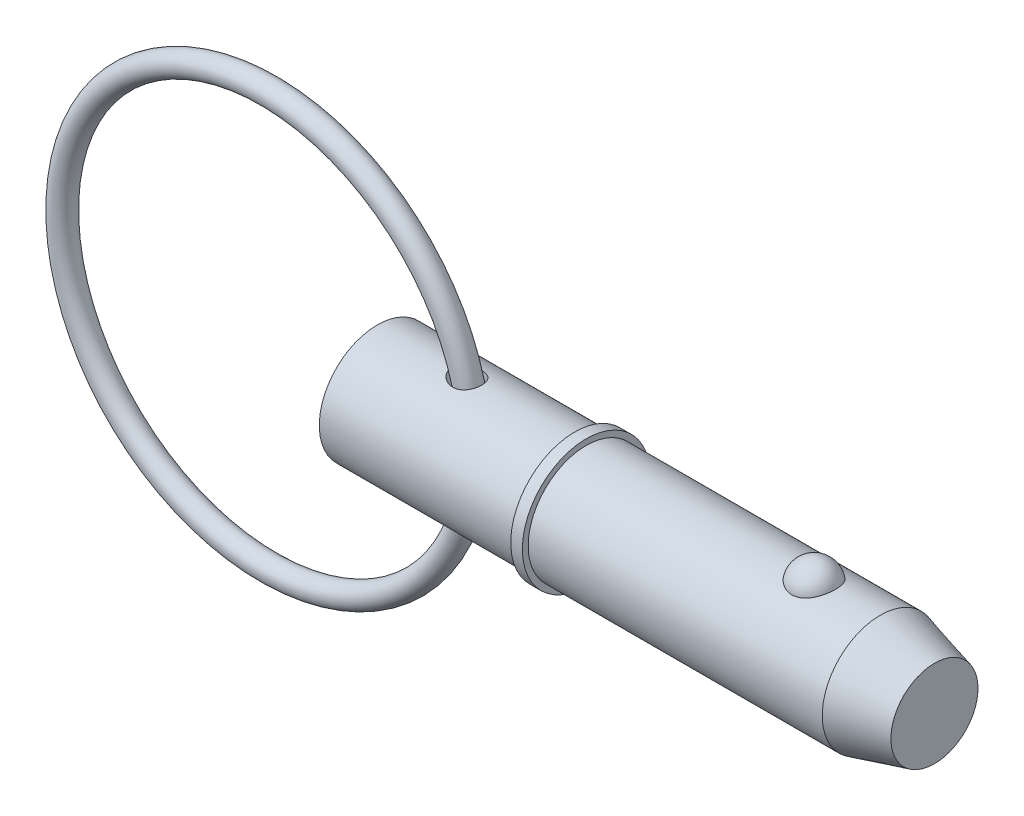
ISO-10303-21;
HEADER;
FILE_DESCRIPTION(('STEP AP214'),'2;1');
FILE_NAME('part.step','',(''),(''),'','','');
FILE_SCHEMA(('AUTOMOTIVE_DESIGN { 1 0 10303 214 1 1 1 1 }'));
ENDSEC;
DATA;
#1=APPLICATION_CONTEXT('core data for automotive mechanical design processes');
#2=APPLICATION_PROTOCOL_DEFINITION('international standard','automotive_design',2000,#1);
#3=PRODUCT_CONTEXT('',#1,'mechanical');
#4=PRODUCT('Part','Part','',(#3));
#5=PRODUCT_RELATED_PRODUCT_CATEGORY('part','',(#4));
#6=PRODUCT_DEFINITION_FORMATION('','',#4);
#7=PRODUCT_DEFINITION_CONTEXT('part definition',#1,'design');
#8=PRODUCT_DEFINITION('design','',#6,#7);
#9=PRODUCT_DEFINITION_SHAPE('','',#8);
#10=(LENGTH_UNIT() NAMED_UNIT(*) SI_UNIT(.MILLI.,.METRE.));
#11=(NAMED_UNIT(*) PLANE_ANGLE_UNIT() SI_UNIT($,.RADIAN.));
#12=(NAMED_UNIT(*) SI_UNIT($,.STERADIAN.) SOLID_ANGLE_UNIT());
#13=UNCERTAINTY_MEASURE_WITH_UNIT(LENGTH_MEASURE(1.E-05),#10,'distance_accuracy_value','');
#14=(GEOMETRIC_REPRESENTATION_CONTEXT(3) GLOBAL_UNCERTAINTY_ASSIGNED_CONTEXT((#13)) GLOBAL_UNIT_ASSIGNED_CONTEXT((#10,
#11,#12)) REPRESENTATION_CONTEXT('',''));
#15=CARTESIAN_POINT('',(0.,0.,0.));
#16=DIRECTION('',(0.,0.,1.));
#17=DIRECTION('',(1.,0.,0.));
#18=AXIS2_PLACEMENT_3D('',#15,#16,#17);
#19=CARTESIAN_POINT('',(-13.3805387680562,0.,0.));
#20=DIRECTION('',(0.,0.,1.));
#21=DIRECTION('',(1.,0.,0.));
#22=AXIS2_PLACEMENT_3D('',#19,#20,#21);
#23=TOROIDAL_SURFACE('',#22,25.4,1.429);
#24=CARTESIAN_POINT('',(13.4484612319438,0.,0.));
#25=VERTEX_POINT('',#24);
#26=VERTEX_LOOP('',#25);
#27=FACE_BOUND('',#26,.T.);
#28=ADVANCED_FACE('P0_F12',(#27),#23,.T.);
#29=CLOSED_SHELL('',(#28));
#30=MANIFOLD_SOLID_BREP('P0_B1',#29);
#31=CARTESIAN_POINT('',(0.,0.,0.));
#32=DIRECTION('',(1.,0.,0.));
#33=DIRECTION('',(0.,0.,-1.));
#34=AXIS2_PLACEMENT_3D('',#31,#32,#33);
#35=CYLINDRICAL_SURFACE('',#34,7.145);
#36=CARTESIAN_POINT('',(9.43029029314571,7.0820748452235,-0.94617170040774));
#37=CARTESIAN_POINT('',(9.49289741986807,7.07004660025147,-1.03619677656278));
#38=CARTESIAN_POINT('',(9.56370593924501,7.05703049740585,-1.12049617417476));
#39=CARTESIAN_POINT('',(9.71869321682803,7.03060933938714,-1.27585605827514));
#40=CARTESIAN_POINT('',(9.80290151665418,7.01720347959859,-1.34688652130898));
#41=CARTESIAN_POINT('',(9.98160385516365,6.99158714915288,-1.47408585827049));
#42=CARTESIAN_POINT('',(10.0760626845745,6.97937284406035,-1.53030346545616));
#43=CARTESIAN_POINT('',(10.2729508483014,6.95747410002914,-1.62697341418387));
#44=CARTESIAN_POINT('',(10.3753769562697,6.9477886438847,-1.66743209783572));
#45=CARTESIAN_POINT('',(10.5898946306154,6.93181594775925,-1.73266776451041));
#46=CARTESIAN_POINT('',(10.7022085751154,6.92567913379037,-1.75675727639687));
#47=CARTESIAN_POINT('',(10.9294935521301,6.91839634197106,-1.78523005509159));
#48=CARTESIAN_POINT('',(11.0444638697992,6.91724903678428,-1.78961856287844));
#49=CARTESIAN_POINT('',(11.2673249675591,6.92023954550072,-1.77801517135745));
#50=CARTESIAN_POINT('',(11.3752729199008,6.9241055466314,-1.7630715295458));
#51=CARTESIAN_POINT('',(11.5865707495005,6.93632220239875,-1.71437618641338));
#52=CARTESIAN_POINT('',(11.6899227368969,6.94467077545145,-1.68063321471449));
#53=CARTESIAN_POINT('',(11.8814537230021,6.96412118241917,-1.59802791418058));
#54=CARTESIAN_POINT('',(11.9701885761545,6.97498839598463,-1.55039425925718));
#55=CARTESIAN_POINT('',(12.1379548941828,6.99847346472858,-1.44066970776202));
#56=CARTESIAN_POINT('',(12.216987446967,7.01109112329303,-1.37858043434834));
#57=CARTESIAN_POINT('',(12.3614636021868,7.03632910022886,-1.24326778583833));
#58=CARTESIAN_POINT('',(12.4271729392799,7.04894297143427,-1.17032635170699));
#59=CARTESIAN_POINT('',(12.5455377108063,7.07306867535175,-1.01436746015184));
#60=CARTESIAN_POINT('',(12.5981928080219,7.08458047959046,-0.931349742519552));
#61=CARTESIAN_POINT('',(12.6896059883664,7.10535787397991,-0.756770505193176));
#62=CARTESIAN_POINT('',(12.7282356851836,7.11460247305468,-0.665139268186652));
#63=CARTESIAN_POINT('',(12.7900431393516,7.12971795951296,-0.476541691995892));
#64=CARTESIAN_POINT('',(12.8132203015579,7.13558871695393,-0.379575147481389));
#65=CARTESIAN_POINT('',(12.843715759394,7.14336270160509,-0.182249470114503));
#66=CARTESIAN_POINT('',(12.8509095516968,7.14523477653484,-0.081869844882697));
#67=CARTESIAN_POINT('',(12.8489064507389,7.14471772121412,0.118715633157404));
#68=CARTESIAN_POINT('',(12.8397092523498,7.14232851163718,0.218921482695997));
#69=CARTESIAN_POINT('',(12.8051110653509,7.13353949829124,0.41644658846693));
#70=CARTESIAN_POINT('',(12.7796895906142,7.12713462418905,0.513762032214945));
#71=CARTESIAN_POINT('',(12.7132079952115,7.1110024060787,0.702607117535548));
#72=CARTESIAN_POINT('',(12.6721476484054,7.10127501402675,0.79413667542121));
#73=CARTESIAN_POINT('',(12.5754142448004,7.07957648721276,0.968687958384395));
#74=CARTESIAN_POINT('',(12.5197583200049,7.06760798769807,1.05171950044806));
#75=CARTESIAN_POINT('',(12.3951873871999,7.04275315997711,1.20699878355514));
#76=CARTESIAN_POINT('',(12.3262733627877,7.02986689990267,1.27924732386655));
#77=CARTESIAN_POINT('',(12.1775943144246,7.00473797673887,1.41035599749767));
#78=CARTESIAN_POINT('',(12.0979195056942,6.99249102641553,1.46931758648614));
#79=CARTESIAN_POINT('',(11.9295314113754,6.96991222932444,1.57295053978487));
#80=CARTESIAN_POINT('',(11.840819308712,6.9595801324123,1.61762377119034));
#81=CARTESIAN_POINT('',(11.6577653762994,6.9420462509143,1.69128599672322));
#82=CARTESIAN_POINT('',(11.5634812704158,6.93481718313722,1.72041226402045));
#83=CARTESIAN_POINT('',(11.3712731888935,6.92407027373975,1.76316901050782));
#84=CARTESIAN_POINT('',(11.2733489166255,6.92055273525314,1.7767982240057));
#85=CARTESIAN_POINT('',(11.0745092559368,6.91745053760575,1.78883853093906));
#86=CARTESIAN_POINT('',(10.9735737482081,6.91794816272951,1.7869312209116));
#87=CARTESIAN_POINT('',(10.7732766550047,6.92286647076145,1.76777696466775));
#88=CARTESIAN_POINT('',(10.6739155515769,6.92728833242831,1.75052540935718));
#89=CARTESIAN_POINT('',(10.4726907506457,6.93987626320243,1.69995986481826));
#90=CARTESIAN_POINT('',(10.3710860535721,6.94826759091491,1.66567223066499));
#91=CARTESIAN_POINT('',(10.1746512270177,6.96783543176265,1.5818155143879));
#92=CARTESIAN_POINT('',(10.0798244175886,6.97901329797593,1.53223900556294));
#93=CARTESIAN_POINT('',(9.89353725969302,7.00369413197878,1.41530336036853));
#94=CARTESIAN_POINT('',(9.80266896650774,7.01729943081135,1.34701798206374));
#95=CARTESIAN_POINT('',(9.63408859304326,7.0446567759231,1.19571433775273));
#96=CARTESIAN_POINT('',(9.55637809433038,7.05840883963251,1.11269430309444));
#97=CARTESIAN_POINT('',(9.41909992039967,7.083998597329,0.935821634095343));
#98=CARTESIAN_POINT('',(9.35912834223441,7.09587546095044,0.842290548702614));
#99=CARTESIAN_POINT('',(9.25811978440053,7.11649414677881,0.645207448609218));
#100=CARTESIAN_POINT('',(9.21705789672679,7.12524008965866,0.541668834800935));
#101=CARTESIAN_POINT('',(9.16044503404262,7.13745944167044,0.341322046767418));
#102=CARTESIAN_POINT('',(9.14237352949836,7.14144984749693,0.245257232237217));
#103=CARTESIAN_POINT('',(9.12416132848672,7.14547143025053,0.0513577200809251));
#104=CARTESIAN_POINT('',(9.12401221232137,7.14550446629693,-0.0464761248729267));
#105=CARTESIAN_POINT('',(9.14075660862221,7.14180686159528,-0.230866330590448));
#106=CARTESIAN_POINT('',(9.15598246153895,7.13844450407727,-0.317588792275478));
#107=CARTESIAN_POINT('',(9.20015637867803,7.1288735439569,-0.487231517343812));
#108=CARTESIAN_POINT('',(9.22909411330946,7.12266708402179,-0.570154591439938));
#109=CARTESIAN_POINT('',(9.2869632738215,7.11060500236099,-0.702183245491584));
#110=CARTESIAN_POINT('',(9.3123377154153,7.10538970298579,-0.752949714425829));
#111=CARTESIAN_POINT('',(9.36784352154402,7.09422889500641,-0.851709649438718));
#112=CARTESIAN_POINT('',(9.39797435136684,7.08828346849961,-0.899703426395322));
#113=CARTESIAN_POINT('',(9.43029029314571,7.0820748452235,-0.94617170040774));
#114=B_SPLINE_CURVE_WITH_KNOTS('',3,(#36,#37,#38,#39,#40,#41,#42,#43,#44,#45,#46,#47,#48,#49,
#50,#51,#52,#53,#54,#55,#56,#57,#58,#59,#60,#61,#62,#63,#64,#65,#66,#67,#68,#69,#70,#71,#72,#73,
#74,#75,#76,#77,#78,#79,#80,#81,#82,#83,#84,#85,#86,#87,#88,#89,#90,#91,#92,#93,#94,#95,#96,#97,
#98,#99,#100,#101,#102,#103,#104,#105,#106,#107,#108,#109,#110,#111,#112,#113),.UNSPECIFIED.,
.T.,.F.,(4,2,2,2,2,2,2,2,2,2,2,2,2,2,2,2,2,2,2,2,2,2,2,2,2,2,2,2,2,2,2,2,2,2,2,2,2,2,4),(0.,
0.330712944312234,0.662165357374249,0.992513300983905,1.32272815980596,1.66607248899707,
2.00932547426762,2.33472339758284,2.65997034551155,2.96236844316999,3.26473260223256,
3.56029376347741,3.85586255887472,4.15407251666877,4.45229395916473,4.75283038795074,
5.05337241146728,5.35429467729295,5.6552212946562,5.95579625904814,6.25634893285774,
6.55452242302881,6.85265693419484,7.14811357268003,7.44359434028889,7.74514565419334,
8.04678757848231,8.36809025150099,8.68954924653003,9.03133562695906,9.37316306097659,
9.70647113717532,10.0393389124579,10.3311793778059,10.6228827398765,10.8860177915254,
11.1489549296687,11.3196783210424,11.4903825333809),.UNSPECIFIED.);
#115=CARTESIAN_POINT('',(9.43029029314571,7.0820748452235,-0.94617170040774));
#116=VERTEX_POINT('',#115);
#117=EDGE_CURVE('P1_E42',#116,#116,#114,.T.);
#118=ORIENTED_EDGE('',*,*,#117,.T.);
#119=EDGE_LOOP('',(#118));
#120=FACE_BOUND('',#119,.T.);
#121=CARTESIAN_POINT('',(0.,0.,0.));
#122=DIRECTION('',(1.,0.,0.));
#123=DIRECTION('',(0.,0.,-1.));
#124=AXIS2_PLACEMENT_3D('',#121,#122,#123);
#125=CIRCLE('',#124,7.145);
#126=CARTESIAN_POINT('',(0.,0.,-7.145));
#127=VERTEX_POINT('',#126);
#128=EDGE_CURVE('P1_E9',#127,#127,#125,.T.);
#129=ORIENTED_EDGE('',*,*,#128,.T.);
#130=EDGE_LOOP('',(#129));
#131=FACE_BOUND('',#130,.T.);
#132=CARTESIAN_POINT('',(24.271,0.,0.));
#133=DIRECTION('',(1.,0.,0.));
#134=DIRECTION('',(0.,0.,-1.));
#135=AXIS2_PLACEMENT_3D('',#132,#133,#134);
#136=CIRCLE('',#135,7.145);
#137=CARTESIAN_POINT('',(24.271,0.,-7.145));
#138=VERTEX_POINT('',#137);
#139=EDGE_CURVE('P1_E25',#138,#138,#136,.T.);
#140=ORIENTED_EDGE('',*,*,#139,.F.);
#141=EDGE_LOOP('',(#140));
#142=FACE_BOUND('',#141,.T.);
#143=CARTESIAN_POINT('',(9.43029029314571,-7.0820748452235,-0.94617170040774));
#144=CARTESIAN_POINT('',(9.37760063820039,-7.09219753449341,-0.870403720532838));
#145=CARTESIAN_POINT('',(9.33068640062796,-7.10162619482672,-0.790535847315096));
#146=CARTESIAN_POINT('',(9.25028000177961,-7.11818229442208,-0.624083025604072));
#147=CARTESIAN_POINT('',(9.21677847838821,-7.12531133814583,-0.53750281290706));
#148=CARTESIAN_POINT('',(9.16475883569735,-7.13651886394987,-0.359324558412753));
#149=CARTESIAN_POINT('',(9.14630423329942,-7.14058440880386,-0.267706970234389));
#150=CARTESIAN_POINT('',(9.12573334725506,-7.14512216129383,-0.082561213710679));
#151=CARTESIAN_POINT('',(9.12361335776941,-7.1455951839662,0.0109665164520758));
#152=CARTESIAN_POINT('',(9.13548667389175,-7.14296952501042,0.191627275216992));
#153=CARTESIAN_POINT('',(9.14858103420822,-7.14007009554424,0.278824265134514));
#154=CARTESIAN_POINT('',(9.18869656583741,-7.1313430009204,0.449782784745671));
#155=CARTESIAN_POINT('',(9.21571947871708,-7.1255149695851,0.533543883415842));
#156=CARTESIAN_POINT('',(9.282939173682,-7.11140544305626,0.696984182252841));
#157=CARTESIAN_POINT('',(9.32334793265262,-7.10308469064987,0.776572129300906));
#158=CARTESIAN_POINT('',(9.41555290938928,-7.08481187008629,0.928623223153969));
#159=CARTESIAN_POINT('',(9.4673531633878,-7.07485922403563,1.00108383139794));
#160=CARTESIAN_POINT('',(9.58690514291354,-7.05302654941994,1.14530893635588));
#161=CARTESIAN_POINT('',(9.65578345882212,-7.04105486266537,1.21612477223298));
#162=CARTESIAN_POINT('',(9.80342908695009,-7.01727063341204,1.34660507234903));
#163=CARTESIAN_POINT('',(9.88220203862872,-7.00545818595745,1.40626312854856));
#164=CARTESIAN_POINT('',(10.0573217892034,-6.9817739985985,1.51973713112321));
#165=CARTESIAN_POINT('',(10.1546474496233,-6.9700532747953,1.57208037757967));
#166=CARTESIAN_POINT('',(10.3567277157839,-6.94950828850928,1.66055104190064));
#167=CARTESIAN_POINT('',(10.4614845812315,-6.94068491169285,1.69667350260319));
#168=CARTESIAN_POINT('',(10.6792116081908,-6.92685379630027,1.75230777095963));
#169=CARTESIAN_POINT('',(10.7923373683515,-6.92197732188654,1.77125049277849));
#170=CARTESIAN_POINT('',(11.0202699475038,-6.91736328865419,1.78919210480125));
#171=CARTESIAN_POINT('',(11.1350759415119,-6.91762328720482,1.78820047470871));
#172=CARTESIAN_POINT('',(11.355627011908,-6.92328130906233,1.76615765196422));
#173=CARTESIAN_POINT('',(11.4615007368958,-6.92836826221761,1.74632083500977));
#174=CARTESIAN_POINT('',(11.6678083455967,-6.94272508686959,1.68833625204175));
#175=CARTESIAN_POINT('',(11.7682443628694,-6.9519933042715,1.65019572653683));
#176=CARTESIAN_POINT('',(11.9539217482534,-6.97285816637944,1.55957439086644));
#177=CARTESIAN_POINT('',(12.0397280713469,-6.98426147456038,1.50820229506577));
#178=CARTESIAN_POINT('',(12.2011249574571,-7.00842344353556,1.39160266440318));
#179=CARTESIAN_POINT('',(12.276716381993,-7.0211819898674,1.32637629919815));
#180=CARTESIAN_POINT('',(12.4144868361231,-7.04639315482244,1.18508369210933));
#181=CARTESIAN_POINT('',(12.4768620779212,-7.05884739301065,1.10920872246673));
#182=CARTESIAN_POINT('',(12.5881779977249,-7.08230185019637,0.947973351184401));
#183=CARTESIAN_POINT('',(12.6371182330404,-7.09330202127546,0.862612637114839));
#184=CARTESIAN_POINT('',(12.7208404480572,-7.11277016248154,0.683871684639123));
#185=CARTESIAN_POINT('',(12.7554736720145,-7.12121129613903,0.590418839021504));
#186=CARTESIAN_POINT('',(12.8090653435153,-7.13450309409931,0.398877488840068));
#187=CARTESIAN_POINT('',(12.8280232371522,-7.13935363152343,0.300788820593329));
#188=CARTESIAN_POINT('',(12.8499077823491,-7.14496695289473,0.102058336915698));
#189=CARTESIAN_POINT('',(12.8527265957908,-7.14570223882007,0.0014038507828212));
#190=CARTESIAN_POINT('',(12.8419792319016,-7.14293198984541,-0.198968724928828));
#191=CARTESIAN_POINT('',(12.8284127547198,-7.13942637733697,-0.298686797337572));
#192=CARTESIAN_POINT('',(12.7851853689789,-7.12854635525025,-0.494442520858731));
#193=CARTESIAN_POINT('',(12.7555107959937,-7.12116866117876,-0.590476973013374));
#194=CARTESIAN_POINT('',(12.6807437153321,-7.10334272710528,-0.776042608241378));
#195=CARTESIAN_POINT('',(12.6356510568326,-7.09289445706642,-0.865573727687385));
#196=CARTESIAN_POINT('',(12.5312128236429,-7.07009703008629,-1.03541867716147));
#197=CARTESIAN_POINT('',(12.4718917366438,-7.0577511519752,-1.11574799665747));
#198=CARTESIAN_POINT('',(12.3404461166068,-7.03252701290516,-1.26504204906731));
#199=CARTESIAN_POINT('',(12.2683227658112,-7.01964880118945,-1.33400783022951));
#200=CARTESIAN_POINT('',(12.1139052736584,-6.99493588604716,-1.45803732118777));
#201=CARTESIAN_POINT('',(12.031708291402,-6.98309284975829,-1.51322032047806));
#202=CARTESIAN_POINT('',(11.858962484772,-6.96164945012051,-1.60900039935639));
#203=CARTESIAN_POINT('',(11.7684146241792,-6.95204882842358,-1.6495991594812));
#204=CARTESIAN_POINT('',(11.5822744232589,-6.93618392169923,-1.71508374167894));
#205=CARTESIAN_POINT('',(11.4867225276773,-6.92989640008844,-1.74007923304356));
#206=CARTESIAN_POINT('',(11.292703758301,-6.92114809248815,-1.77455680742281));
#207=CARTESIAN_POINT('',(11.1942365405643,-6.91868775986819,-1.7840370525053));
#208=CARTESIAN_POINT('',(10.9943797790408,-6.91771041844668,-1.78782317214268));
#209=CARTESIAN_POINT('',(10.8929824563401,-6.9193005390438,-1.78171679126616));
#210=CARTESIAN_POINT('',(10.6924353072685,-6.92632816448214,-1.75419409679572));
#211=CARTESIAN_POINT('',(10.5932861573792,-6.93176681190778,-1.73277323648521));
#212=CARTESIAN_POINT('',(10.3927770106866,-6.94630717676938,-1.67356884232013));
#213=CARTESIAN_POINT('',(10.2917367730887,-6.95563581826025,-1.63475796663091));
#214=CARTESIAN_POINT('',(10.0971768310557,-6.97681957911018,-1.54184188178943));
#215=CARTESIAN_POINT('',(10.0036623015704,-6.9886764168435,-1.48772626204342));
#216=CARTESIAN_POINT('',(9.82098935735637,-7.01440230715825,-1.36146688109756));
#217=CARTESIAN_POINT('',(9.73247440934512,-7.0283510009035,-1.28840361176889));
#218=CARTESIAN_POINT('',(9.56978695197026,-7.05591334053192,-1.12770855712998));
#219=CARTESIAN_POINT('',(9.49560170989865,-7.06952727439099,-1.0400898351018));
#220=CARTESIAN_POINT('',(9.43029029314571,-7.0820748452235,-0.94617170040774));
#221=B_SPLINE_CURVE_WITH_KNOTS('',3,(#143,#144,#145,#146,#147,#148,#149,#150,#151,#152,#153,
#154,#155,#156,#157,#158,#159,#160,#161,#162,#163,#164,#165,#166,#167,#168,#169,#170,#171,#172,
#173,#174,#175,#176,#177,#178,#179,#180,#181,#182,#183,#184,#185,#186,#187,#188,#189,#190,#191,
#192,#193,#194,#195,#196,#197,#198,#199,#200,#201,#202,#203,#204,#205,#206,#207,#208,#209,#210,
#211,#212,#213,#214,#215,#216,#217,#218,#219,#220),.UNSPECIFIED.,.T.,.F.,(4,2,2,2,2,2,2,2,2,2,2,
2,2,2,2,2,2,2,2,2,2,2,2,2,2,2,2,2,2,2,2,2,2,2,2,2,2,2,4),(0.,0.278197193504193,
0.556199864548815,0.835370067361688,1.11447693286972,1.37789669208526,1.64134939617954,
1.90919123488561,2.17712812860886,2.47446254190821,2.77196719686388,3.10386520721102,
3.43586457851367,3.77849767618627,4.1209678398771,4.44276705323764,4.76443907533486,
5.0649452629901,5.36542609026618,5.66107282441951,5.95672929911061,6.25538683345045,
6.5540549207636,6.85471634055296,7.15538326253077,7.45630563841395,7.75723095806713,
8.05764204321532,8.35802540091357,8.65571107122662,8.95336242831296,9.24889743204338,
9.54446744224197,9.84793560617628,10.1514939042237,10.4760045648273,10.8007364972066,
11.1458836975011,11.4907227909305),.UNSPECIFIED.);
#222=CARTESIAN_POINT('',(9.43029029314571,-7.0820748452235,-0.94617170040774));
#223=VERTEX_POINT('',#222);
#224=EDGE_CURVE('P1_E17',#223,#223,#221,.T.);
#225=ORIENTED_EDGE('',*,*,#224,.T.);
#226=EDGE_LOOP('',(#225));
#227=FACE_BOUND('',#226,.T.);
#228=ADVANCED_FACE('P1_F13',(#120,#131,#142,#227),#35,.T.);
#229=CARTESIAN_POINT('',(0.,0.,0.));
#230=DIRECTION('',(1.,0.,0.));
#231=DIRECTION('',(0.,0.,-1.));
#232=AXIS2_PLACEMENT_3D('',#229,#230,#231);
#233=CYLINDRICAL_SURFACE('',#232,7.145);
#234=CARTESIAN_POINT('',(61.8836242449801,0.,0.));
#235=DIRECTION('',(1.,0.,0.));
#236=DIRECTION('',(0.,0.,-1.));
#237=AXIS2_PLACEMENT_3D('',#234,#235,#236);
#238=CIRCLE('',#237,7.145);
#239=CARTESIAN_POINT('',(61.8836242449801,0.,-7.145));
#240=VERTEX_POINT('',#239);
#241=EDGE_CURVE('P1_E99',#240,#240,#238,.T.);
#242=ORIENTED_EDGE('',*,*,#241,.F.);
#243=EDGE_LOOP('',(#242));
#244=FACE_BOUND('',#243,.T.);
#245=CARTESIAN_POINT('',(25.7,0.,0.));
#246=DIRECTION('',(1.,0.,0.));
#247=DIRECTION('',(0.,0.,-1.));
#248=AXIS2_PLACEMENT_3D('',#245,#246,#247);
#249=CIRCLE('',#248,7.145);
#250=CARTESIAN_POINT('',(25.7,0.,-7.145));
#251=VERTEX_POINT('',#250);
#252=EDGE_CURVE('P1_E96',#251,#251,#249,.T.);
#253=ORIENTED_EDGE('',*,*,#252,.T.);
#254=EDGE_LOOP('',(#253));
#255=FACE_BOUND('',#254,.T.);
#256=CARTESIAN_POINT('',(53.7395037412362,6.60328629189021,2.72903557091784));
#257=CARTESIAN_POINT('',(53.598315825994,6.60329644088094,2.72902496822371));
#258=CARTESIAN_POINT('',(53.4568832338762,6.60799490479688,2.71772840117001));
#259=CARTESIAN_POINT('',(53.1779557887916,6.62628236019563,2.67281935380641));
#260=CARTESIAN_POINT('',(53.0404726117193,6.63989534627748,2.63914664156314));
#261=CARTESIAN_POINT('',(52.7738894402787,6.67440775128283,2.55059642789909));
#262=CARTESIAN_POINT('',(52.6447683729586,6.69528793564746,2.49577486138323));
#263=CARTESIAN_POINT('',(52.3978694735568,6.74205585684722,2.3665179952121));
#264=CARTESIAN_POINT('',(52.2800865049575,6.76794130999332,2.29209163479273));
#265=CARTESIAN_POINT('',(52.0551671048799,6.82286177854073,2.1231293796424));
#266=CARTESIAN_POINT('',(51.9484405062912,6.85196655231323,2.02807107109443));
#267=CARTESIAN_POINT('',(51.7519181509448,6.90970232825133,1.82167822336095));
#268=CARTESIAN_POINT('',(51.6621276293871,6.93833318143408,1.71033867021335));
#269=CARTESIAN_POINT('',(51.4976670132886,6.9935167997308,1.46891951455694));
#270=CARTESIAN_POINT('',(51.423844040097,7.01992110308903,1.33822781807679));
#271=CARTESIAN_POINT('',(51.2980884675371,7.06643385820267,1.06566567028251));
#272=CARTESIAN_POINT('',(51.2461573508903,7.08654188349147,0.923794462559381));
#273=CARTESIAN_POINT('',(51.1647323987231,7.11862399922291,0.630993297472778));
#274=CARTESIAN_POINT('',(51.1355167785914,7.13049704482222,0.479974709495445));
#275=CARTESIAN_POINT('',(51.1011742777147,7.14449484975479,0.174782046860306));
#276=CARTESIAN_POINT('',(51.0960466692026,7.14661990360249,0.0206080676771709));
#277=CARTESIAN_POINT('',(51.109938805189,7.14092465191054,-0.285506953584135));
#278=CARTESIAN_POINT('',(51.1288101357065,7.1331654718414,-0.437455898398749));
#279=CARTESIAN_POINT('',(51.1900622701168,7.10859076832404,-0.735778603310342));
#280=CARTESIAN_POINT('',(51.2324435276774,7.0917750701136,-0.882152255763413));
#281=CARTESIAN_POINT('',(51.3399346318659,7.05076716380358,-1.16543149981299));
#282=CARTESIAN_POINT('',(51.4050759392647,7.02656475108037,-1.30232366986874));
#283=CARTESIAN_POINT('',(51.5567597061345,6.97329145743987,-1.56265907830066));
#284=CARTESIAN_POINT('',(51.643303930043,6.94422017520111,-1.68610120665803));
#285=CARTESIAN_POINT('',(51.8364654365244,6.88415108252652,-1.9167100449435));
#286=CARTESIAN_POINT('',(51.9431807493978,6.85314438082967,-2.02379244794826));
#287=CARTESIAN_POINT('',(52.1739740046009,6.79282069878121,-2.21787433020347));
#288=CARTESIAN_POINT('',(52.2980505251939,6.76350358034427,-2.30487545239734));
#289=CARTESIAN_POINT('',(52.5576784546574,6.71060580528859,-2.45458647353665));
#290=CARTESIAN_POINT('',(52.6929387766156,6.68691885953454,-2.51776240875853));
#291=CARTESIAN_POINT('',(52.9732778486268,6.64741247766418,-2.62030218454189));
#292=CARTESIAN_POINT('',(53.118352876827,6.63159007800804,-2.65967499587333));
#293=CARTESIAN_POINT('',(53.4063475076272,6.61038594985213,-2.71193301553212));
#294=CARTESIAN_POINT('',(53.5490080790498,6.60451880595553,-2.72605165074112));
#295=CARTESIAN_POINT('',(53.8348004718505,6.60240611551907,-2.73116688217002));
#296=CARTESIAN_POINT('',(53.9779321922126,6.60615862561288,-2.72216814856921));
#297=CARTESIAN_POINT('',(54.2558486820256,6.62256094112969,-2.68200435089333));
#298=CARTESIAN_POINT('',(54.3907542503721,6.63492533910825,-2.65154998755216));
#299=CARTESIAN_POINT('',(54.65332009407,6.66687445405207,-2.5701568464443));
#300=CARTESIAN_POINT('',(54.7809797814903,6.68645975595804,-2.51921640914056));
#301=CARTESIAN_POINT('',(55.0285777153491,6.73127274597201,-2.39693610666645));
#302=CARTESIAN_POINT('',(55.148287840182,6.75661381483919,-2.32517694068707));
#303=CARTESIAN_POINT('',(55.3741592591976,6.8100600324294,-2.16363812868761));
#304=CARTESIAN_POINT('',(55.480317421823,6.83816581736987,-2.07385432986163));
#305=CARTESIAN_POINT('',(55.6818620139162,6.89580469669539,-1.87357235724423));
#306=CARTESIAN_POINT('',(55.776440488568,6.92533863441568,-1.76226074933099));
#307=CARTESIAN_POINT('',(55.9463329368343,6.98139526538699,-1.52511696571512));
#308=CARTESIAN_POINT('',(56.0216434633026,7.0079174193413,-1.39928219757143));
#309=CARTESIAN_POINT('',(56.153595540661,7.05607625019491,-1.13215977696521));
#310=CARTESIAN_POINT('',(56.2095688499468,7.07753119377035,-0.99050847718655));
#311=CARTESIAN_POINT('',(56.2982965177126,7.11222355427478,-0.699154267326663));
#312=CARTESIAN_POINT('',(56.3310506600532,7.12546089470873,-0.549451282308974));
#313=CARTESIAN_POINT('',(56.3726899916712,7.14237584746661,-0.246120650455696));
#314=CARTESIAN_POINT('',(56.381558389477,7.14604673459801,-0.0924903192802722));
#315=CARTESIAN_POINT('',(56.3751940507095,7.14343510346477,0.214181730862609));
#316=CARTESIAN_POINT('',(56.3599618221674,7.13715279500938,0.367223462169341));
#317=CARTESIAN_POINT('',(56.3058451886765,7.11532948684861,0.667595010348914));
#318=CARTESIAN_POINT('',(56.2670776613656,7.09983424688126,0.814949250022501));
#319=CARTESIAN_POINT('',(56.1667700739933,7.06119140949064,1.10063221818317));
#320=CARTESIAN_POINT('',(56.1052284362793,7.03804328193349,1.23896032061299));
#321=CARTESIAN_POINT('',(55.9602071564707,6.98632429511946,1.50352300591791));
#322=CARTESIAN_POINT('',(55.8766067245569,6.95772382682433,1.62968561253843));
#323=CARTESIAN_POINT('',(55.6893804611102,6.89823072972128,1.86554304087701));
#324=CARTESIAN_POINT('',(55.5857557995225,6.86733823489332,1.97523882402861));
#325=CARTESIAN_POINT('',(55.3610769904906,6.80676456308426,2.17482293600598));
#326=CARTESIAN_POINT('',(55.2400673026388,6.7770805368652,2.26476035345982));
#327=CARTESIAN_POINT('',(54.9833408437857,6.7223050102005,2.42252989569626));
#328=CARTESIAN_POINT('',(54.8476185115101,6.69721525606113,2.49035362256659));
#329=CARTESIAN_POINT('',(54.5704022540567,6.65552591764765,2.59967646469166));
#330=CARTESIAN_POINT('',(54.4292810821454,6.63865794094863,2.6420201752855));
#331=CARTESIAN_POINT('',(54.1414448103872,6.61425039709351,2.7025584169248));
#332=CARTESIAN_POINT('',(53.9947480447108,6.606682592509,2.72082606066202));
#333=CARTESIAN_POINT('',(53.8116799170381,6.60358754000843,2.72830331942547));
#334=CARTESIAN_POINT('',(53.7755998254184,6.60328369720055,2.72903828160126));
#335=CARTESIAN_POINT('',(53.7395037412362,6.60328629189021,2.72903557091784));
#336=B_SPLINE_CURVE_WITH_KNOTS('',3,(#256,#257,#258,#259,#260,#261,#262,#263,#264,#265,#266,
#267,#268,#269,#270,#271,#272,#273,#274,#275,#276,#277,#278,#279,#280,#281,#282,#283,#284,#285,
#286,#287,#288,#289,#290,#291,#292,#293,#294,#295,#296,#297,#298,#299,#300,#301,#302,#303,#304,
#305,#306,#307,#308,#309,#310,#311,#312,#313,#314,#315,#316,#317,#318,#319,#320,#321,#322,#323,
#324,#325,#326,#327,#328,#329,#330,#331,#332,#333,#334,#335),.UNSPECIFIED.,.T.,.F.,(4,2,2,2,2,2,
2,2,2,2,2,2,2,2,2,2,2,2,2,2,2,2,2,2,2,2,2,2,2,2,2,2,2,2,2,2,2,2,2,4),(0.,0.423468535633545,
0.848081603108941,1.27157926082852,1.69488414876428,2.13051395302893,2.56627819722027,
3.02136706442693,3.47648674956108,3.93709649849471,4.39769233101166,4.85545355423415,
5.31322361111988,5.77162895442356,6.23007210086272,6.69080337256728,7.15149693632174,
7.60264329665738,8.05361952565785,8.48189729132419,8.91008854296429,9.32472524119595,
9.73939553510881,10.1630783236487,10.5868588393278,11.0319070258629,11.4770347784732,
11.9362874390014,12.3955443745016,12.8551240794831,13.3146940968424,13.7720003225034,
14.2293382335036,14.6892343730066,15.1491036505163,15.6078171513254,16.0667046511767,
16.5093965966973,16.9507410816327,17.0590049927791),.UNSPECIFIED.);
#337=CARTESIAN_POINT('',(53.7395037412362,6.60328629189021,2.72903557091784));
#338=VERTEX_POINT('',#337);
#339=EDGE_CURVE('P1_E34',#338,#338,#336,.T.);
#340=ORIENTED_EDGE('',*,*,#339,.T.);
#341=EDGE_LOOP('',(#340));
#342=FACE_BOUND('',#341,.T.);
#343=ADVANCED_FACE('P1_F46',(#244,#255,#342),#233,.T.);
#344=CARTESIAN_POINT('',(0.,0.,0.));
#345=DIRECTION('',(-1.,0.,0.));
#346=DIRECTION('',(0.,0.,1.));
#347=AXIS2_PLACEMENT_3D('',#344,#345,#346);
#348=PLANE('',#347);
#349=ORIENTED_EDGE('',*,*,#128,.F.);
#350=EDGE_LOOP('',(#349));
#351=FACE_BOUND('',#350,.T.);
#352=ADVANCED_FACE('P1_F15',(#351),#348,.T.);
#353=CARTESIAN_POINT('',(24.271,7.145,0.));
#354=DIRECTION('',(-1.,0.,0.));
#355=DIRECTION('',(0.,0.,1.));
#356=AXIS2_PLACEMENT_3D('',#353,#354,#355);
#357=PLANE('',#356);
#358=ORIENTED_EDGE('',*,*,#139,.T.);
#359=EDGE_LOOP('',(#358));
#360=FACE_BOUND('',#359,.T.);
#361=CARTESIAN_POINT('',(24.271,0.,0.));
#362=DIRECTION('',(1.,0.,0.));
#363=DIRECTION('',(0.,0.,-1.));
#364=AXIS2_PLACEMENT_3D('',#361,#362,#363);
#365=CIRCLE('',#364,7.8595);
#366=CARTESIAN_POINT('',(24.271,0.,-7.8595));
#367=VERTEX_POINT('',#366);
#368=EDGE_CURVE('P1_E30',#367,#367,#365,.T.);
#369=ORIENTED_EDGE('',*,*,#368,.F.);
#370=EDGE_LOOP('',(#369));
#371=FACE_BOUND('',#370,.T.);
#372=ADVANCED_FACE('P1_F81',(#360,#371),#357,.T.);
#373=CARTESIAN_POINT('',(0.,0.,0.));
#374=DIRECTION('',(1.,0.,0.));
#375=DIRECTION('',(0.,0.,-1.));
#376=AXIS2_PLACEMENT_3D('',#373,#374,#375);
#377=CYLINDRICAL_SURFACE('',#376,7.8595);
#378=ORIENTED_EDGE('',*,*,#368,.T.);
#379=EDGE_LOOP('',(#378));
#380=FACE_BOUND('',#379,.T.);
#381=CARTESIAN_POINT('',(25.7,0.,0.));
#382=DIRECTION('',(1.,0.,0.));
#383=DIRECTION('',(0.,0.,-1.));
#384=AXIS2_PLACEMENT_3D('',#381,#382,#383);
#385=CIRCLE('',#384,7.8595);
#386=CARTESIAN_POINT('',(25.7,0.,-7.8595));
#387=VERTEX_POINT('',#386);
#388=EDGE_CURVE('P1_E95',#387,#387,#385,.T.);
#389=ORIENTED_EDGE('',*,*,#388,.F.);
#390=EDGE_LOOP('',(#389));
#391=FACE_BOUND('',#390,.T.);
#392=ADVANCED_FACE('P1_F68',(#380,#391),#377,.T.);
#393=CARTESIAN_POINT('',(25.7,7.8595,0.));
#394=DIRECTION('',(1.,0.,0.));
#395=DIRECTION('',(0.,0.,-1.));
#396=AXIS2_PLACEMENT_3D('',#393,#394,#395);
#397=PLANE('',#396);
#398=ORIENTED_EDGE('',*,*,#388,.T.);
#399=EDGE_LOOP('',(#398));
#400=FACE_BOUND('',#399,.T.);
#401=ORIENTED_EDGE('',*,*,#252,.F.);
#402=EDGE_LOOP('',(#401));
#403=FACE_BOUND('',#402,.T.);
#404=ADVANCED_FACE('P1_F62',(#400,#403),#397,.T.);
#405=CARTESIAN_POINT('',(68.55,0.,0.));
#406=DIRECTION('',(-1.,0.,0.));
#407=DIRECTION('',(0.,0.,1.));
#408=AXIS2_PLACEMENT_3D('',#405,#406,#407);
#409=CONICAL_SURFACE('',#408,5.35875000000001,0.261799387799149);
#410=ORIENTED_EDGE('',*,*,#241,.T.);
#411=EDGE_LOOP('',(#410));
#412=FACE_BOUND('',#411,.T.);
#413=CARTESIAN_POINT('',(68.55,0.,0.));
#414=DIRECTION('',(1.,0.,0.));
#415=DIRECTION('',(0.,0.,-1.));
#416=AXIS2_PLACEMENT_3D('',#413,#414,#415);
#417=CIRCLE('',#416,5.35875000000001);
#418=CARTESIAN_POINT('',(68.55,0.,-5.35875000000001));
#419=VERTEX_POINT('',#418);
#420=EDGE_CURVE('P1_E41',#419,#419,#417,.T.);
#421=ORIENTED_EDGE('',*,*,#420,.F.);
#422=EDGE_LOOP('',(#421));
#423=FACE_BOUND('',#422,.T.);
#424=ADVANCED_FACE('P1_F59',(#412,#423),#409,.T.);
#425=CARTESIAN_POINT('',(68.55,5.35875000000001,0.));
#426=DIRECTION('',(1.,0.,0.));
#427=DIRECTION('',(0.,0.,-1.));
#428=AXIS2_PLACEMENT_3D('',#425,#426,#427);
#429=PLANE('',#428);
#430=ORIENTED_EDGE('',*,*,#420,.T.);
#431=EDGE_LOOP('',(#430));
#432=FACE_BOUND('',#431,.T.);
#433=ADVANCED_FACE('P1_F55',(#432),#429,.T.);
#434=CARTESIAN_POINT('',(53.7395037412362,6.43049999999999,0.));
#435=DIRECTION('',(-1.,0.,0.));
#436=DIRECTION('',(0.,1.,0.));
#437=AXIS2_PLACEMENT_3D('',#434,#435,#436);
#438=SPHERICAL_SURFACE('',#437,2.73450000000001);
#439=ORIENTED_EDGE('',*,*,#339,.F.);
#440=EDGE_LOOP('',(#439));
#441=FACE_BOUND('',#440,.T.);
#442=ADVANCED_FACE('P1_F50',(#441),#438,.T.);
#443=CARTESIAN_POINT('',(-13.3805387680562,0.,0.));
#444=DIRECTION('',(0.,0.,1.));
#445=DIRECTION('',(1.,0.,0.));
#446=AXIS2_PLACEMENT_3D('',#443,#444,#445);
#447=TOROIDAL_SURFACE('',#446,25.4,1.78625);
#448=ORIENTED_EDGE('',*,*,#224,.F.);
#449=EDGE_LOOP('',(#448));
#450=FACE_BOUND('',#449,.T.);
#451=ORIENTED_EDGE('',*,*,#117,.F.);
#452=EDGE_LOOP('',(#451));
#453=FACE_BOUND('',#452,.T.);
#454=ADVANCED_FACE('P1_F54',(#450,#453),#447,.F.);
#455=CLOSED_SHELL('',(#228,#343,#352,#372,#392,#404,#424,#433,#442,#454));
#456=MANIFOLD_SOLID_BREP('P1_B1',#455);
#457=ADVANCED_BREP_SHAPE_REPRESENTATION('',(#18,#30,#456),#14);
#458=SHAPE_DEFINITION_REPRESENTATION(#9,#457);
ENDSEC;
END-ISO-10303-21;
